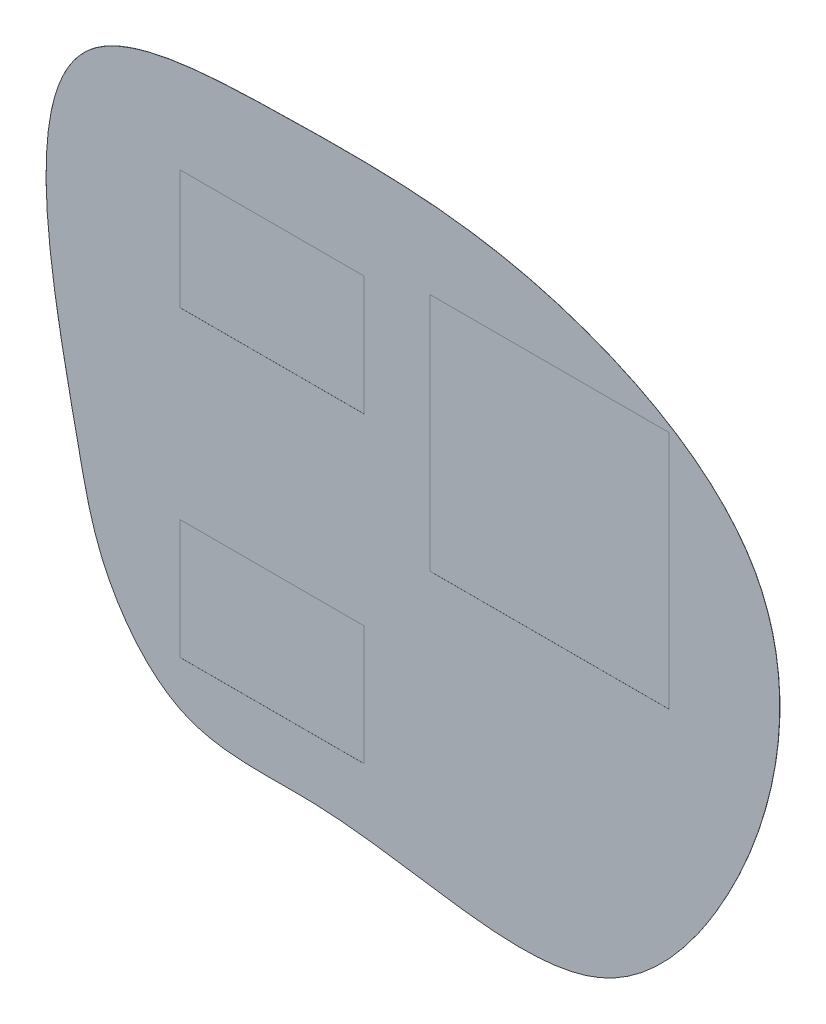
from build123d import *

# Parameters (mm, degrees)
BOSS_EXTRU_1_DEPTH      = 2
ESQUISSE2_W             = 3135.624578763
ESQUISSE2_H             = 2032.778677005
ESQUISSE2_H_2           = 2032.778677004
ESQUISSE2_W_2           = 4070.304737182
ESQUISSE2_H_3           = 4079.513571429
ENL_V_MAT_EXTRU_1_DEPTH = 1


with BuildPart() as part:
    # Esquisse1 → Boss.-Extru.1 (new body)
    with BuildSketch(Plane.XY):
        with BuildLine():
            add(Edge.make_bspline(
                [(1542.947560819, -5058.387893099), (1029.481906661, -5915.455661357), (-775.521263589, -7962.410863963), (-4371.495427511, -6612.879870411), (-7626.760142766, -7043.785591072), (-8971.485606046, -5229.650411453), (-9568.180506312, -2273.478426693), (-10747.010524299, 2849.961866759), (-5225.469121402, 3046.116755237), (-1543.956145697, 3047.429233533), (3432.280997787, 524.462417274), (2567.675477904, -3347.930218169), (1542.947560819, -5058.387893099)],
                knots=[0, 0, 0, 0, 0.0739184, 0.206079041, 0.268812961, 0.324370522, 0.365015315, 0.527066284, 0.614173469, 0.740308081, 0.8524804, 1, 1, 1, 1], degree=3))
        make_face()
    extrude(amount=-BOSS_EXTRU_1_DEPTH)

    # Esquisse2 → Enl_v. mat.-Extru.1 (cut)
    with BuildSketch(Plane.XY):
        with Locations((-6008.689009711, -4839.759456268)):
            Rectangle(ESQUISSE2_W, ESQUISSE2_H)
        with Locations((-6008.689009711, 316.834489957)):
            Rectangle(ESQUISSE2_W, ESQUISSE2_H_2)
        with Locations((-1283.894970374, -417.450708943)):
            Rectangle(ESQUISSE2_W_2, ESQUISSE2_H_3)
    extrude(amount=-ENL_V_MAT_EXTRU_1_DEPTH, mode=Mode.SUBTRACT)


solid = part.part
